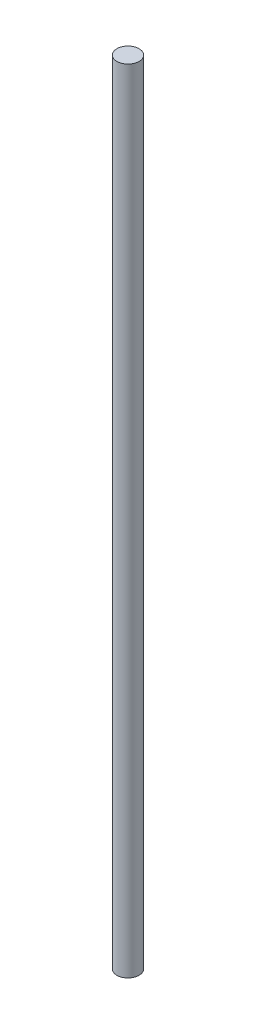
ISO-10303-21;
HEADER;
FILE_DESCRIPTION(('STEP AP214'),'2;1');
FILE_NAME('part.step','',(''),(''),'','','');
FILE_SCHEMA(('AUTOMOTIVE_DESIGN { 1 0 10303 214 1 1 1 1 }'));
ENDSEC;
DATA;
#1=APPLICATION_CONTEXT('core data for automotive mechanical design processes');
#2=APPLICATION_PROTOCOL_DEFINITION('international standard','automotive_design',2000,#1);
#3=PRODUCT_CONTEXT('',#1,'mechanical');
#4=PRODUCT('Part','Part','',(#3));
#5=PRODUCT_RELATED_PRODUCT_CATEGORY('part','',(#4));
#6=PRODUCT_DEFINITION_FORMATION('','',#4);
#7=PRODUCT_DEFINITION_CONTEXT('part definition',#1,'design');
#8=PRODUCT_DEFINITION('design','',#6,#7);
#9=PRODUCT_DEFINITION_SHAPE('','',#8);
#10=(LENGTH_UNIT() NAMED_UNIT(*) SI_UNIT(.MILLI.,.METRE.));
#11=(NAMED_UNIT(*) PLANE_ANGLE_UNIT() SI_UNIT($,.RADIAN.));
#12=(NAMED_UNIT(*) SI_UNIT($,.STERADIAN.) SOLID_ANGLE_UNIT());
#13=UNCERTAINTY_MEASURE_WITH_UNIT(LENGTH_MEASURE(1.E-05),#10,'distance_accuracy_value','');
#14=(GEOMETRIC_REPRESENTATION_CONTEXT(3) GLOBAL_UNCERTAINTY_ASSIGNED_CONTEXT((#13)) GLOBAL_UNIT_ASSIGNED_CONTEXT((#10,
#11,#12)) REPRESENTATION_CONTEXT('',''));
#15=CARTESIAN_POINT('',(0.,0.,0.));
#16=DIRECTION('',(0.,0.,1.));
#17=DIRECTION('',(1.,0.,0.));
#18=AXIS2_PLACEMENT_3D('',#15,#16,#17);
#19=CARTESIAN_POINT('',(0.,500.,0.));
#20=DIRECTION('',(0.,-1.,0.));
#21=DIRECTION('',(0.,0.,-1.));
#22=AXIS2_PLACEMENT_3D('',#19,#20,#21);
#23=CYLINDRICAL_SURFACE('',#22,7.);
#24=CARTESIAN_POINT('',(0.,500.,0.));
#25=DIRECTION('',(0.,1.,0.));
#26=DIRECTION('',(0.,0.,1.));
#27=AXIS2_PLACEMENT_3D('',#24,#25,#26);
#28=CIRCLE('',#27,7.);
#29=CARTESIAN_POINT('',(0.,500.,7.));
#30=VERTEX_POINT('',#29);
#31=EDGE_CURVE('E10',#30,#30,#28,.T.);
#32=ORIENTED_EDGE('',*,*,#31,.F.);
#33=EDGE_LOOP('',(#32));
#34=FACE_BOUND('',#33,.T.);
#35=CARTESIAN_POINT('',(0.,0.,0.));
#36=DIRECTION('',(0.,1.,0.));
#37=DIRECTION('',(0.,0.,1.));
#38=AXIS2_PLACEMENT_3D('',#35,#36,#37);
#39=CIRCLE('',#38,7.);
#40=CARTESIAN_POINT('',(0.,0.,7.));
#41=VERTEX_POINT('',#40);
#42=EDGE_CURVE('E34',#41,#41,#39,.T.);
#43=ORIENTED_EDGE('',*,*,#42,.T.);
#44=EDGE_LOOP('',(#43));
#45=FACE_BOUND('',#44,.T.);
#46=ADVANCED_FACE('F31',(#34,#45),#23,.T.);
#47=CARTESIAN_POINT('',(0.,500.,0.));
#48=DIRECTION('',(0.,1.,0.));
#49=DIRECTION('',(0.,0.,1.));
#50=AXIS2_PLACEMENT_3D('',#47,#48,#49);
#51=PLANE('',#50);
#52=ORIENTED_EDGE('',*,*,#31,.T.);
#53=EDGE_LOOP('',(#52));
#54=FACE_BOUND('',#53,.T.);
#55=ADVANCED_FACE('F46',(#54),#51,.T.);
#56=CARTESIAN_POINT('',(0.,0.,0.));
#57=DIRECTION('',(0.,1.,0.));
#58=DIRECTION('',(0.,0.,1.));
#59=AXIS2_PLACEMENT_3D('',#56,#57,#58);
#60=PLANE('',#59);
#61=ORIENTED_EDGE('',*,*,#42,.F.);
#62=EDGE_LOOP('',(#61));
#63=FACE_BOUND('',#62,.T.);
#64=ADVANCED_FACE('F44',(#63),#60,.F.);
#65=CLOSED_SHELL('',(#46,#55,#64));
#66=MANIFOLD_SOLID_BREP('B2',#65);
#67=ADVANCED_BREP_SHAPE_REPRESENTATION('',(#18,#66),#14);
#68=SHAPE_DEFINITION_REPRESENTATION(#9,#67);
ENDSEC;
END-ISO-10303-21;
